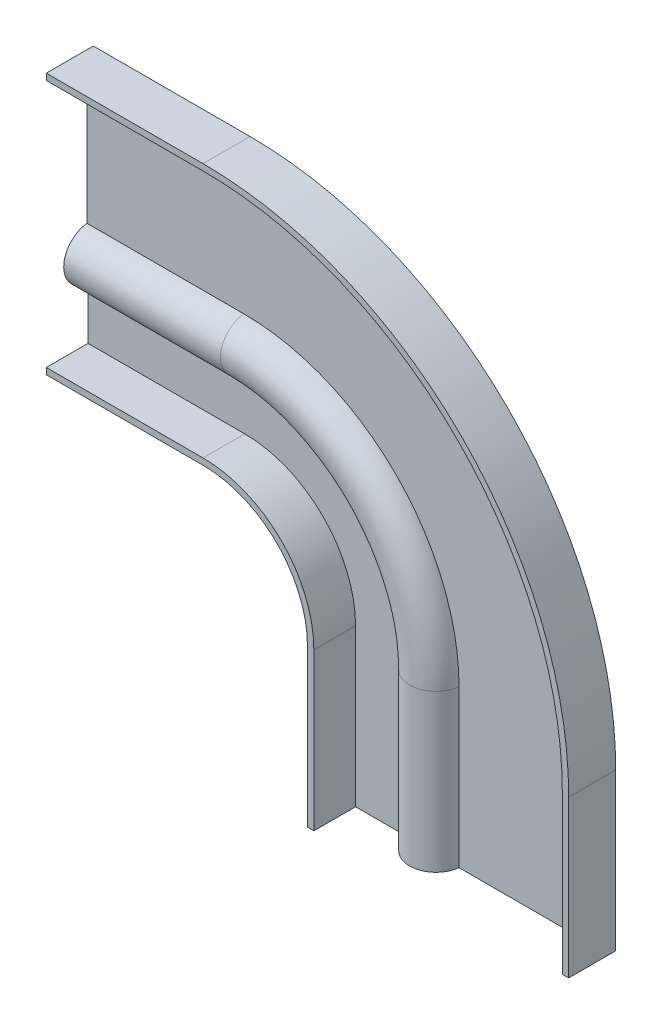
from build123d import *


with BuildPart() as part:
    # Sweep1: sweep along a path in Sketch1
    with BuildLine(Plane.XY) as sweep1_path:
        Line((50, -50), (50, -20))
        ThreePointArc((50, -20), (44.142135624, -5.857864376), (30, 0))
        Line((30, 0), (0, 0))
    # Sketch2 → Sweep1 (sweep)
    with BuildSketch(Plane(origin=(0, 0, 0), x_dir=(0, 0, -1), z_dir=(1, 0, 0))):
        with BuildLine():
            Line((-9, 50), (0, 50))
            Line((0, 50), (0, 19.994828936))
            ThreePointArc((0, 19.994828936), (-4.448390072, 16.214), (0, 12.433171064))
            Line((0, 12.433171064), (0, 0))
            Line((0, 0), (-9, 0))
            Line((-9, 0), (-9, 1.214))
            Line((-9, 1.214), (-1.014264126, 1.214))
            Line((-1.014264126, 1.214), (-1.014264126, 11.184709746))
            ThreePointArc((-1.014264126, 11.184709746), (-5.661391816, 16.113644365), (-1.214, 21.223526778))
            Line((-1.214, 21.223526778), (-1.214, 48.786))
            Line((-1.214, 48.786), (-9, 48.786))
            Line((-9, 48.786), (-9, 50))
        make_face()
    sweep(path=sweep1_path.line)


solid = part.part
